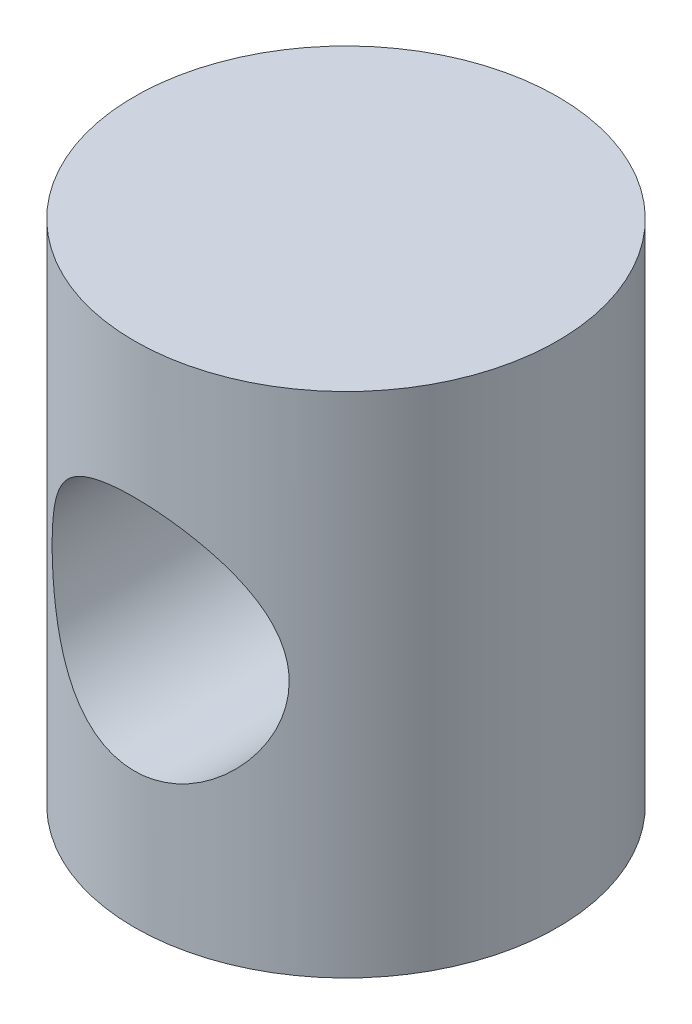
from build123d import *

# Parameters (mm, degrees)
SKETCH_1_R          = 50
EXTRUDE_1_DEPTH     = 120
SKETCH_2_R          = 28
CUT_EXTRUDE_1_DEPTH = 55


with BuildPart() as part:
    # Sketch 1 → Extrude 1 (new body)
    with BuildSketch(Plane(origin=(0, 0, 0), x_dir=(1, 0, 0), z_dir=(0, 1, 0))):
        with Locations(Location((0, 0, 0), (0, 0, 270))):
            Circle(SKETCH_1_R)
    extrude(amount=EXTRUDE_1_DEPTH)

    # Sketch 2 → Cut-Extrude 1 (cut, symmetric)
    with BuildSketch(Plane.XY):
        with Locations(Location((0, 60, 0), (0, 0, 89.999999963))):
            Circle(SKETCH_2_R)
    extrude(amount=CUT_EXTRUDE_1_DEPTH, both=True, mode=Mode.SUBTRACT)


solid = part.part
